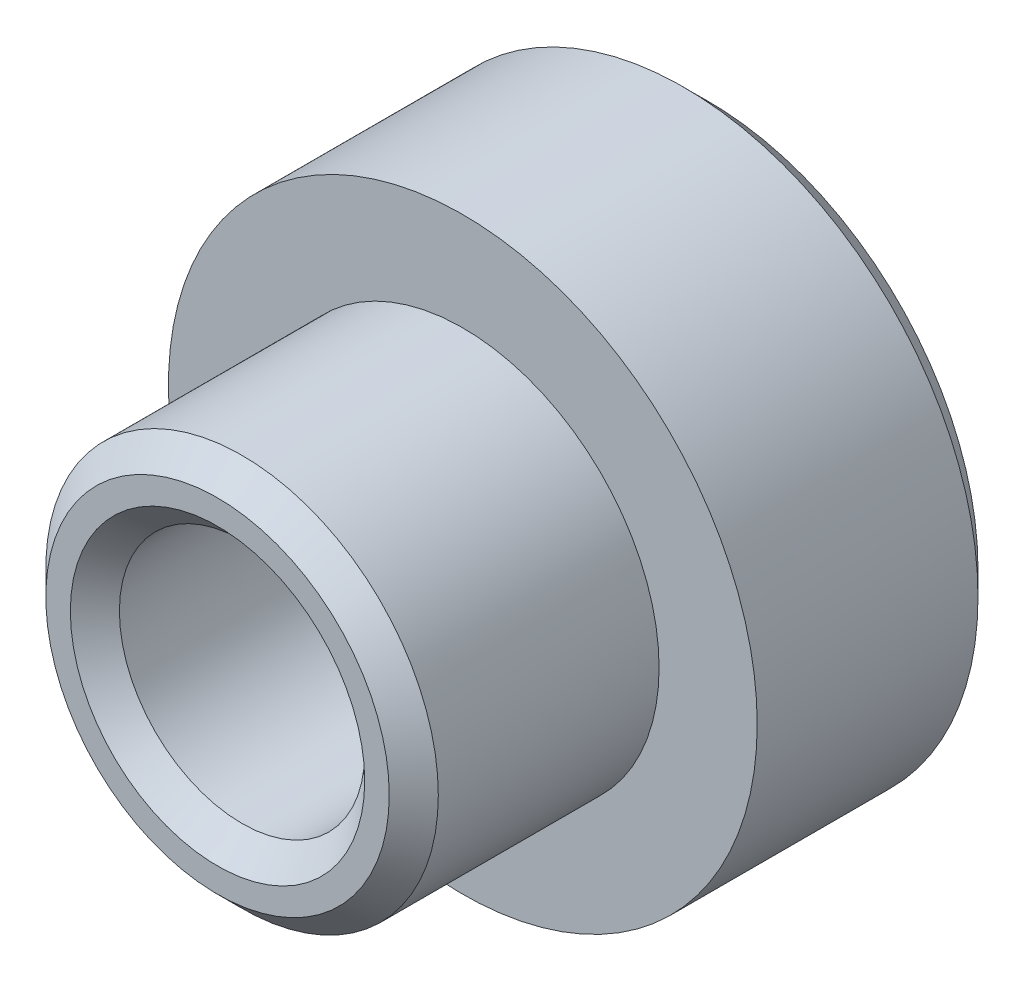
ISO-10303-21;
HEADER;
FILE_DESCRIPTION(('STEP AP214'),'2;1');
FILE_NAME('part.step','',(''),(''),'','','');
FILE_SCHEMA(('AUTOMOTIVE_DESIGN { 1 0 10303 214 1 1 1 1 }'));
ENDSEC;
DATA;
#1=APPLICATION_CONTEXT('core data for automotive mechanical design processes');
#2=APPLICATION_PROTOCOL_DEFINITION('international standard','automotive_design',2000,#1);
#3=PRODUCT_CONTEXT('',#1,'mechanical');
#4=PRODUCT('Part','Part','',(#3));
#5=PRODUCT_RELATED_PRODUCT_CATEGORY('part','',(#4));
#6=PRODUCT_DEFINITION_FORMATION('','',#4);
#7=PRODUCT_DEFINITION_CONTEXT('part definition',#1,'design');
#8=PRODUCT_DEFINITION('design','',#6,#7);
#9=PRODUCT_DEFINITION_SHAPE('','',#8);
#10=(LENGTH_UNIT() NAMED_UNIT(*) SI_UNIT(.MILLI.,.METRE.));
#11=(NAMED_UNIT(*) PLANE_ANGLE_UNIT() SI_UNIT($,.RADIAN.));
#12=(NAMED_UNIT(*) SI_UNIT($,.STERADIAN.) SOLID_ANGLE_UNIT());
#13=UNCERTAINTY_MEASURE_WITH_UNIT(LENGTH_MEASURE(1.E-05),#10,'distance_accuracy_value','');
#14=(GEOMETRIC_REPRESENTATION_CONTEXT(3) GLOBAL_UNCERTAINTY_ASSIGNED_CONTEXT((#13)) GLOBAL_UNIT_ASSIGNED_CONTEXT((#10,
#11,#12)) REPRESENTATION_CONTEXT('',''));
#15=CARTESIAN_POINT('',(0.,0.,0.));
#16=DIRECTION('',(0.,0.,1.));
#17=DIRECTION('',(1.,0.,0.));
#18=AXIS2_PLACEMENT_3D('',#15,#16,#17);
#19=CARTESIAN_POINT('',(0.,0.,5.));
#20=DIRECTION('',(0.,0.,1.));
#21=DIRECTION('',(1.,0.,0.));
#22=AXIS2_PLACEMENT_3D('',#19,#20,#21);
#23=PLANE('',#22);
#24=CARTESIAN_POINT('',(0.,0.,5.));
#25=DIRECTION('',(0.,0.,1.));
#26=DIRECTION('',(1.,0.,0.));
#27=AXIS2_PLACEMENT_3D('',#24,#25,#26);
#28=CIRCLE('',#27,6.);
#29=CARTESIAN_POINT('',(6.,0.,5.));
#30=VERTEX_POINT('',#29);
#31=EDGE_CURVE('E61',#30,#30,#28,.T.);
#32=ORIENTED_EDGE('',*,*,#31,.T.);
#33=EDGE_LOOP('',(#32));
#34=FACE_BOUND('',#33,.T.);
#35=CARTESIAN_POINT('',(0.,0.,5.));
#36=DIRECTION('',(0.,0.,1.));
#37=DIRECTION('',(1.,0.,0.));
#38=AXIS2_PLACEMENT_3D('',#35,#36,#37);
#39=CIRCLE('',#38,4.);
#40=CARTESIAN_POINT('',(4.,0.,5.));
#41=VERTEX_POINT('',#40);
#42=EDGE_CURVE('E64',#41,#41,#39,.T.);
#43=ORIENTED_EDGE('',*,*,#42,.F.);
#44=EDGE_LOOP('',(#43));
#45=FACE_BOUND('',#44,.T.);
#46=ADVANCED_FACE('F29',(#34,#45),#23,.T.);
#47=CARTESIAN_POINT('',(0.,0.,0.));
#48=DIRECTION('',(0.,0.,1.));
#49=DIRECTION('',(1.,0.,0.));
#50=AXIS2_PLACEMENT_3D('',#47,#48,#49);
#51=PLANE('',#50);
#52=CARTESIAN_POINT('',(0.,0.,0.));
#53=DIRECTION('',(0.,0.,1.));
#54=DIRECTION('',(1.,0.,0.));
#55=AXIS2_PLACEMENT_3D('',#52,#53,#54);
#56=CIRCLE('',#55,3.00000000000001);
#57=CARTESIAN_POINT('',(3.00000000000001,0.,0.));
#58=VERTEX_POINT('',#57);
#59=EDGE_CURVE('E55',#58,#58,#56,.T.);
#60=ORIENTED_EDGE('',*,*,#59,.T.);
#61=EDGE_LOOP('',(#60));
#62=FACE_BOUND('',#61,.T.);
#63=CARTESIAN_POINT('',(0.,0.,0.));
#64=DIRECTION('',(0.,0.,1.));
#65=DIRECTION('',(1.,0.,0.));
#66=AXIS2_PLACEMENT_3D('',#63,#64,#65);
#67=CIRCLE('',#66,5.5);
#68=CARTESIAN_POINT('',(5.5,0.,0.));
#69=VERTEX_POINT('',#68);
#70=EDGE_CURVE('E58',#69,#69,#67,.F.);
#71=ORIENTED_EDGE('',*,*,#70,.T.);
#72=EDGE_LOOP('',(#71));
#73=FACE_BOUND('',#72,.T.);
#74=ADVANCED_FACE('F71',(#62,#73),#51,.F.);
#75=CARTESIAN_POINT('',(0.,0.,5.));
#76=DIRECTION('',(0.,0.,-1.));
#77=DIRECTION('',(-1.,0.,0.));
#78=AXIS2_PLACEMENT_3D('',#75,#76,#77);
#79=CYLINDRICAL_SURFACE('',#78,6.);
#80=CARTESIAN_POINT('',(0.,0.,0.500000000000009));
#81=DIRECTION('',(0.,0.,1.));
#82=DIRECTION('',(1.,0.,0.));
#83=AXIS2_PLACEMENT_3D('',#80,#81,#82);
#84=CIRCLE('',#83,6.);
#85=CARTESIAN_POINT('',(6.,0.,0.500000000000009));
#86=VERTEX_POINT('',#85);
#87=EDGE_CURVE('E44',#86,#86,#84,.T.);
#88=ORIENTED_EDGE('',*,*,#87,.T.);
#89=EDGE_LOOP('',(#88));
#90=FACE_BOUND('',#89,.T.);
#91=ORIENTED_EDGE('',*,*,#31,.F.);
#92=EDGE_LOOP('',(#91));
#93=FACE_BOUND('',#92,.T.);
#94=ADVANCED_FACE('F31',(#90,#93),#79,.T.);
#95=CARTESIAN_POINT('',(0.,0.,5.));
#96=DIRECTION('',(0.,0.,-1.));
#97=DIRECTION('',(-1.,0.,0.));
#98=AXIS2_PLACEMENT_3D('',#95,#96,#97);
#99=CYLINDRICAL_SURFACE('',#98,2.5);
#100=CARTESIAN_POINT('',(0.,0.,0.500000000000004));
#101=DIRECTION('',(0.,0.,1.));
#102=DIRECTION('',(1.,0.,0.));
#103=AXIS2_PLACEMENT_3D('',#100,#101,#102);
#104=CIRCLE('',#103,2.5);
#105=CARTESIAN_POINT('',(2.5,0.,0.500000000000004));
#106=VERTEX_POINT('',#105);
#107=EDGE_CURVE('E49',#106,#106,#104,.F.);
#108=ORIENTED_EDGE('',*,*,#107,.T.);
#109=EDGE_LOOP('',(#108));
#110=FACE_BOUND('',#109,.T.);
#111=CARTESIAN_POINT('',(0.,0.,9.5));
#112=DIRECTION('',(0.,0.,1.));
#113=DIRECTION('',(1.,0.,0.));
#114=AXIS2_PLACEMENT_3D('',#111,#112,#113);
#115=CIRCLE('',#114,2.5);
#116=CARTESIAN_POINT('',(2.5,0.,9.5));
#117=VERTEX_POINT('',#116);
#118=EDGE_CURVE('E52',#117,#117,#115,.T.);
#119=ORIENTED_EDGE('',*,*,#118,.T.);
#120=EDGE_LOOP('',(#119));
#121=FACE_BOUND('',#120,.T.);
#122=ADVANCED_FACE('F79',(#110,#121),#99,.F.);
#123=CARTESIAN_POINT('',(0.,0.,10.));
#124=DIRECTION('',(0.,0.,1.));
#125=DIRECTION('',(1.,0.,0.));
#126=AXIS2_PLACEMENT_3D('',#123,#124,#125);
#127=PLANE('',#126);
#128=CARTESIAN_POINT('',(0.,0.,10.));
#129=DIRECTION('',(0.,0.,1.));
#130=DIRECTION('',(1.,0.,0.));
#131=AXIS2_PLACEMENT_3D('',#128,#129,#130);
#132=CIRCLE('',#131,3.00000000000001);
#133=CARTESIAN_POINT('',(3.00000000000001,0.,10.));
#134=VERTEX_POINT('',#133);
#135=EDGE_CURVE('E36',#134,#134,#132,.F.);
#136=ORIENTED_EDGE('',*,*,#135,.T.);
#137=EDGE_LOOP('',(#136));
#138=FACE_BOUND('',#137,.T.);
#139=CARTESIAN_POINT('',(0.,0.,10.));
#140=DIRECTION('',(0.,0.,1.));
#141=DIRECTION('',(1.,0.,0.));
#142=AXIS2_PLACEMENT_3D('',#139,#140,#141);
#143=CIRCLE('',#142,3.49999999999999);
#144=CARTESIAN_POINT('',(3.49999999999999,0.,10.));
#145=VERTEX_POINT('',#144);
#146=EDGE_CURVE('E40',#145,#145,#143,.T.);
#147=ORIENTED_EDGE('',*,*,#146,.T.);
#148=EDGE_LOOP('',(#147));
#149=FACE_BOUND('',#148,.T.);
#150=ADVANCED_FACE('F82',(#138,#149),#127,.T.);
#151=CARTESIAN_POINT('',(0.,0.,10.));
#152=DIRECTION('',(0.,0.,-1.));
#153=DIRECTION('',(-1.,0.,0.));
#154=AXIS2_PLACEMENT_3D('',#151,#152,#153);
#155=CYLINDRICAL_SURFACE('',#154,4.);
#156=CARTESIAN_POINT('',(0.,0.,9.5));
#157=DIRECTION('',(0.,0.,1.));
#158=DIRECTION('',(1.,0.,0.));
#159=AXIS2_PLACEMENT_3D('',#156,#157,#158);
#160=CIRCLE('',#159,4.);
#161=CARTESIAN_POINT('',(4.,0.,9.5));
#162=VERTEX_POINT('',#161);
#163=EDGE_CURVE('E10',#162,#162,#160,.F.);
#164=ORIENTED_EDGE('',*,*,#163,.T.);
#165=EDGE_LOOP('',(#164));
#166=FACE_BOUND('',#165,.T.);
#167=ORIENTED_EDGE('',*,*,#42,.T.);
#168=EDGE_LOOP('',(#167));
#169=FACE_BOUND('',#168,.T.);
#170=ADVANCED_FACE('F68',(#166,#169),#155,.T.);
#171=CARTESIAN_POINT('',(0.,0.,0.));
#172=DIRECTION('',(0.,0.,-1.));
#173=DIRECTION('',(-1.,0.,0.));
#174=AXIS2_PLACEMENT_3D('',#171,#172,#173);
#175=CONICAL_SURFACE('',#174,3.00000000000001,0.785398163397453);
#176=ORIENTED_EDGE('',*,*,#107,.F.);
#177=EDGE_LOOP('',(#176));
#178=FACE_BOUND('',#177,.T.);
#179=ORIENTED_EDGE('',*,*,#59,.F.);
#180=EDGE_LOOP('',(#179));
#181=FACE_BOUND('',#180,.T.);
#182=ADVANCED_FACE('F86',(#178,#181),#175,.F.);
#183=CARTESIAN_POINT('',(0.,0.,0.500000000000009));
#184=DIRECTION('',(0.,0.,1.));
#185=DIRECTION('',(1.,0.,0.));
#186=AXIS2_PLACEMENT_3D('',#183,#184,#185);
#187=CONICAL_SURFACE('',#186,6.,0.785398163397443);
#188=ORIENTED_EDGE('',*,*,#70,.F.);
#189=EDGE_LOOP('',(#188));
#190=FACE_BOUND('',#189,.T.);
#191=ORIENTED_EDGE('',*,*,#87,.F.);
#192=EDGE_LOOP('',(#191));
#193=FACE_BOUND('',#192,.T.);
#194=ADVANCED_FACE('F91',(#190,#193),#187,.T.);
#195=CARTESIAN_POINT('',(0.,0.,9.5));
#196=DIRECTION('',(0.,0.,1.));
#197=DIRECTION('',(1.,0.,0.));
#198=AXIS2_PLACEMENT_3D('',#195,#196,#197);
#199=CONICAL_SURFACE('',#198,2.5,0.785398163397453);
#200=ORIENTED_EDGE('',*,*,#135,.F.);
#201=EDGE_LOOP('',(#200));
#202=FACE_BOUND('',#201,.T.);
#203=ORIENTED_EDGE('',*,*,#118,.F.);
#204=EDGE_LOOP('',(#203));
#205=FACE_BOUND('',#204,.T.);
#206=ADVANCED_FACE('F95',(#202,#205),#199,.F.);
#207=CARTESIAN_POINT('',(0.,0.,10.));
#208=DIRECTION('',(0.,0.,-1.));
#209=DIRECTION('',(-1.,0.,0.));
#210=AXIS2_PLACEMENT_3D('',#207,#208,#209);
#211=CONICAL_SURFACE('',#210,3.49999999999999,0.785398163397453);
#212=ORIENTED_EDGE('',*,*,#163,.F.);
#213=EDGE_LOOP('',(#212));
#214=FACE_BOUND('',#213,.T.);
#215=ORIENTED_EDGE('',*,*,#146,.F.);
#216=EDGE_LOOP('',(#215));
#217=FACE_BOUND('',#216,.T.);
#218=ADVANCED_FACE('F99',(#214,#217),#211,.T.);
#219=CLOSED_SHELL('',(#46,#74,#94,#122,#150,#170,#182,#194,#206,#218));
#220=MANIFOLD_SOLID_BREP('B2',#219);
#221=ADVANCED_BREP_SHAPE_REPRESENTATION('',(#18,#220),#14);
#222=SHAPE_DEFINITION_REPRESENTATION(#9,#221);
ENDSEC;
END-ISO-10303-21;
